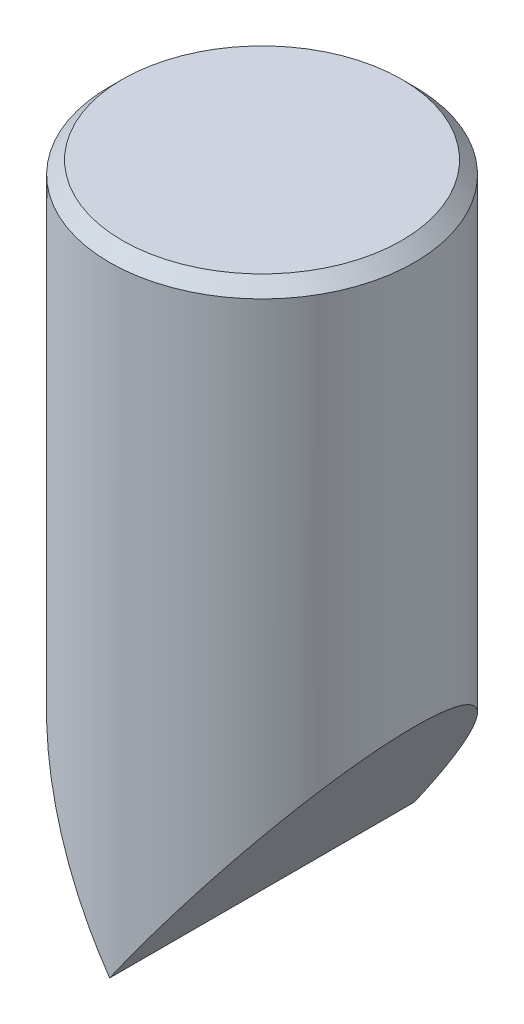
from build123d import *

# Parameters (mm, degrees)
SKETCH_1_R          = 3
EXTRUDE_1_DEPTH     = 12.45
CUT_EXTRUDE_1_DEPTH = 3.5
CHAMFER_1_SIZE      = 0.25


with BuildPart() as part:
    # Sketch 1 → Extrude 1 (new body)
    with BuildSketch(Plane(origin=(0, 0, 0), x_dir=(1, 0, 0), z_dir=(0, 1, 0))):
        with Locations(Location((0, 0, 0), (0, 0, 270))):
            Circle(SKETCH_1_R)
    extrude(amount=EXTRUDE_1_DEPTH)

    # Sketch 2 → Cut-Extrude 1 (cut, symmetric)
    with BuildSketch(Plane.XY):
        Polygon((0, 0), (-3, 4.28444402), (-4.223652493, 4.28444402), (-4.223652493, -0.927959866), (4.714141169, -0.927959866), (4.714141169, 4.28444402), (3, 4.28444402), align=None)
    extrude(amount=CUT_EXTRUDE_1_DEPTH, both=True, mode=Mode.SUBTRACT)

    # Chamfer 1
    chamfer_1_edges = [part.edges().sort_by_distance(p)[0] for p in [
        (0, 12.45, -3),
    ]]
    chamfer(chamfer_1_edges, length=CHAMFER_1_SIZE)


solid = part.part
